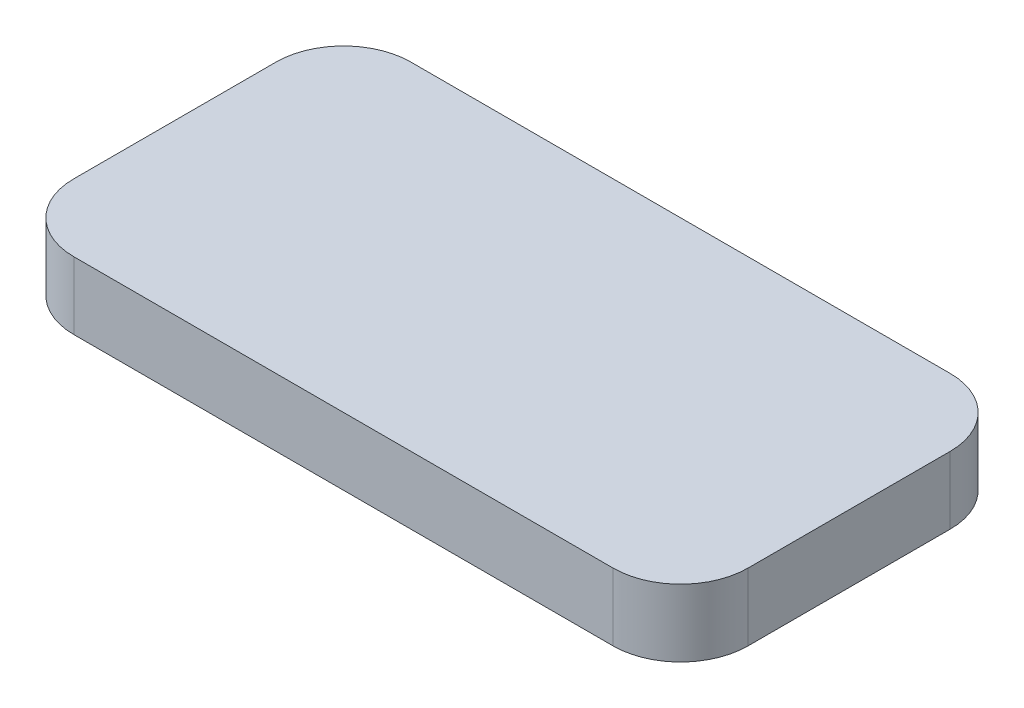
ISO-10303-21;
HEADER;
FILE_DESCRIPTION(('STEP AP214'),'2;1');
FILE_NAME('part.step','',(''),(''),'','','');
FILE_SCHEMA(('AUTOMOTIVE_DESIGN { 1 0 10303 214 1 1 1 1 }'));
ENDSEC;
DATA;
#1=APPLICATION_CONTEXT('core data for automotive mechanical design processes');
#2=APPLICATION_PROTOCOL_DEFINITION('international standard','automotive_design',2000,#1);
#3=PRODUCT_CONTEXT('',#1,'mechanical');
#4=PRODUCT('Part','Part','',(#3));
#5=PRODUCT_RELATED_PRODUCT_CATEGORY('part','',(#4));
#6=PRODUCT_DEFINITION_FORMATION('','',#4);
#7=PRODUCT_DEFINITION_CONTEXT('part definition',#1,'design');
#8=PRODUCT_DEFINITION('design','',#6,#7);
#9=PRODUCT_DEFINITION_SHAPE('','',#8);
#10=(LENGTH_UNIT() NAMED_UNIT(*) SI_UNIT(.MILLI.,.METRE.));
#11=(NAMED_UNIT(*) PLANE_ANGLE_UNIT() SI_UNIT($,.RADIAN.));
#12=(NAMED_UNIT(*) SI_UNIT($,.STERADIAN.) SOLID_ANGLE_UNIT());
#13=UNCERTAINTY_MEASURE_WITH_UNIT(LENGTH_MEASURE(1.E-05),#10,'distance_accuracy_value','');
#14=(GEOMETRIC_REPRESENTATION_CONTEXT(3) GLOBAL_UNCERTAINTY_ASSIGNED_CONTEXT((#13)) GLOBAL_UNIT_ASSIGNED_CONTEXT((#10,
#11,#12)) REPRESENTATION_CONTEXT('',''));
#15=CARTESIAN_POINT('',(0.,0.,0.));
#16=DIRECTION('',(0.,0.,1.));
#17=DIRECTION('',(1.,0.,0.));
#18=AXIS2_PLACEMENT_3D('',#15,#16,#17);
#19=CARTESIAN_POINT('',(20.,20.,-80.));
#20=DIRECTION('',(0.,-1.,0.));
#21=DIRECTION('',(0.,0.,-1.));
#22=AXIS2_PLACEMENT_3D('',#19,#20,#21);
#23=CYLINDRICAL_SURFACE('',#22,20.);
#24=CARTESIAN_POINT('',(20.,0.,-80.));
#25=DIRECTION('',(0.,1.,0.));
#26=DIRECTION('',(0.,0.,-1.));
#27=AXIS2_PLACEMENT_3D('',#24,#25,#26);
#28=CIRCLE('',#27,20.);
#29=CARTESIAN_POINT('',(20.,0.,-100.));
#30=VERTEX_POINT('',#29);
#31=CARTESIAN_POINT('',(0.,0.,-80.));
#32=VERTEX_POINT('',#31);
#33=EDGE_CURVE('E101',#30,#32,#28,.T.);
#34=ORIENTED_EDGE('',*,*,#33,.T.);
#35=DIRECTION('',(0.,-1.,0.));
#36=VECTOR('',#35,1.);
#37=CARTESIAN_POINT('',(0.,20.,-80.));
#38=LINE('',#37,#36);
#39=CARTESIAN_POINT('',(0.,20.,-80.));
#40=VERTEX_POINT('',#39);
#41=EDGE_CURVE('E11',#40,#32,#38,.T.);
#42=ORIENTED_EDGE('',*,*,#41,.F.);
#43=CARTESIAN_POINT('',(20.,20.,-80.));
#44=DIRECTION('',(0.,1.,0.));
#45=DIRECTION('',(0.,0.,-1.));
#46=AXIS2_PLACEMENT_3D('',#43,#44,#45);
#47=CIRCLE('',#46,20.);
#48=CARTESIAN_POINT('',(20.,20.,-100.));
#49=VERTEX_POINT('',#48);
#50=EDGE_CURVE('E128',#49,#40,#47,.T.);
#51=ORIENTED_EDGE('',*,*,#50,.F.);
#52=DIRECTION('',(0.,-1.,0.));
#53=VECTOR('',#52,1.);
#54=CARTESIAN_POINT('',(20.,20.,-100.));
#55=LINE('',#54,#53);
#56=EDGE_CURVE('E114',#49,#30,#55,.T.);
#57=ORIENTED_EDGE('',*,*,#56,.T.);
#58=EDGE_LOOP('',(#34,#42,#51,#57));
#59=FACE_BOUND('',#58,.T.);
#60=ADVANCED_FACE('F33',(#59),#23,.T.);
#61=CARTESIAN_POINT('',(0.,20.,-20.));
#62=DIRECTION('',(1.,0.,0.));
#63=DIRECTION('',(0.,0.,-1.));
#64=AXIS2_PLACEMENT_3D('',#61,#62,#63);
#65=PLANE('',#64);
#66=DIRECTION('',(0.,0.,1.));
#67=VECTOR('',#66,1.);
#68=CARTESIAN_POINT('',(0.,0.,-20.));
#69=LINE('',#68,#67);
#70=CARTESIAN_POINT('',(0.,0.,-20.));
#71=VERTEX_POINT('',#70);
#72=EDGE_CURVE('E97',#32,#71,#69,.T.);
#73=ORIENTED_EDGE('',*,*,#72,.T.);
#74=DIRECTION('',(0.,-1.,0.));
#75=VECTOR('',#74,1.);
#76=CARTESIAN_POINT('',(0.,20.,-20.));
#77=LINE('',#76,#75);
#78=CARTESIAN_POINT('',(0.,20.,-20.));
#79=VERTEX_POINT('',#78);
#80=EDGE_CURVE('E40',#79,#71,#77,.T.);
#81=ORIENTED_EDGE('',*,*,#80,.F.);
#82=DIRECTION('',(0.,0.,1.));
#83=VECTOR('',#82,1.);
#84=CARTESIAN_POINT('',(0.,20.,-20.));
#85=LINE('',#84,#83);
#86=EDGE_CURVE('E110',#40,#79,#85,.T.);
#87=ORIENTED_EDGE('',*,*,#86,.F.);
#88=ORIENTED_EDGE('',*,*,#41,.T.);
#89=EDGE_LOOP('',(#73,#81,#87,#88));
#90=FACE_BOUND('',#89,.T.);
#91=ADVANCED_FACE('F109',(#90),#65,.F.);
#92=CARTESIAN_POINT('',(20.,20.,-20.));
#93=DIRECTION('',(0.,-1.,0.));
#94=DIRECTION('',(0.,0.,-1.));
#95=AXIS2_PLACEMENT_3D('',#92,#93,#94);
#96=CYLINDRICAL_SURFACE('',#95,20.);
#97=CARTESIAN_POINT('',(20.,0.,-20.));
#98=DIRECTION('',(0.,1.,0.));
#99=DIRECTION('',(0.,0.,1.));
#100=AXIS2_PLACEMENT_3D('',#97,#98,#99);
#101=CIRCLE('',#100,20.);
#102=CARTESIAN_POINT('',(20.,0.,0.));
#103=VERTEX_POINT('',#102);
#104=EDGE_CURVE('E103',#71,#103,#101,.T.);
#105=ORIENTED_EDGE('',*,*,#104,.T.);
#106=DIRECTION('',(0.,-1.,0.));
#107=VECTOR('',#106,1.);
#108=CARTESIAN_POINT('',(20.,20.,0.));
#109=LINE('',#108,#107);
#110=CARTESIAN_POINT('',(20.,20.,0.));
#111=VERTEX_POINT('',#110);
#112=EDGE_CURVE('E154',#111,#103,#109,.T.);
#113=ORIENTED_EDGE('',*,*,#112,.F.);
#114=CARTESIAN_POINT('',(20.,20.,-20.));
#115=DIRECTION('',(0.,1.,0.));
#116=DIRECTION('',(0.,0.,1.));
#117=AXIS2_PLACEMENT_3D('',#114,#115,#116);
#118=CIRCLE('',#117,20.);
#119=EDGE_CURVE('E131',#79,#111,#118,.T.);
#120=ORIENTED_EDGE('',*,*,#119,.F.);
#121=ORIENTED_EDGE('',*,*,#80,.T.);
#122=EDGE_LOOP('',(#105,#113,#120,#121));
#123=FACE_BOUND('',#122,.T.);
#124=ADVANCED_FACE('F158',(#123),#96,.T.);
#125=CARTESIAN_POINT('',(20.,20.,0.));
#126=DIRECTION('',(0.,0.,-1.));
#127=DIRECTION('',(-1.,0.,0.));
#128=AXIS2_PLACEMENT_3D('',#125,#126,#127);
#129=PLANE('',#128);
#130=DIRECTION('',(1.,0.,0.));
#131=VECTOR('',#130,1.);
#132=CARTESIAN_POINT('',(20.,0.,0.));
#133=LINE('',#132,#131);
#134=CARTESIAN_POINT('',(180.,0.,0.));
#135=VERTEX_POINT('',#134);
#136=EDGE_CURVE('E118',#103,#135,#133,.T.);
#137=ORIENTED_EDGE('',*,*,#136,.T.);
#138=DIRECTION('',(0.,-1.,0.));
#139=VECTOR('',#138,1.);
#140=CARTESIAN_POINT('',(180.,20.,0.));
#141=LINE('',#140,#139);
#142=CARTESIAN_POINT('',(180.,20.,0.));
#143=VERTEX_POINT('',#142);
#144=EDGE_CURVE('E151',#143,#135,#141,.T.);
#145=ORIENTED_EDGE('',*,*,#144,.F.);
#146=DIRECTION('',(1.,0.,0.));
#147=VECTOR('',#146,1.);
#148=CARTESIAN_POINT('',(20.,20.,0.));
#149=LINE('',#148,#147);
#150=EDGE_CURVE('E133',#111,#143,#149,.T.);
#151=ORIENTED_EDGE('',*,*,#150,.F.);
#152=ORIENTED_EDGE('',*,*,#112,.T.);
#153=EDGE_LOOP('',(#137,#145,#151,#152));
#154=FACE_BOUND('',#153,.T.);
#155=ADVANCED_FACE('F166',(#154),#129,.F.);
#156=CARTESIAN_POINT('',(180.,20.,-20.));
#157=DIRECTION('',(0.,-1.,0.));
#158=DIRECTION('',(0.,0.,-1.));
#159=AXIS2_PLACEMENT_3D('',#156,#157,#158);
#160=CYLINDRICAL_SURFACE('',#159,20.);
#161=CARTESIAN_POINT('',(180.,0.,-20.));
#162=DIRECTION('',(0.,1.,0.));
#163=DIRECTION('',(0.,0.,1.));
#164=AXIS2_PLACEMENT_3D('',#161,#162,#163);
#165=CIRCLE('',#164,20.);
#166=CARTESIAN_POINT('',(200.,0.,-20.));
#167=VERTEX_POINT('',#166);
#168=EDGE_CURVE('E120',#135,#167,#165,.T.);
#169=ORIENTED_EDGE('',*,*,#168,.T.);
#170=DIRECTION('',(0.,-1.,0.));
#171=VECTOR('',#170,1.);
#172=CARTESIAN_POINT('',(200.,20.,-20.));
#173=LINE('',#172,#171);
#174=CARTESIAN_POINT('',(200.,20.,-20.));
#175=VERTEX_POINT('',#174);
#176=EDGE_CURVE('E148',#175,#167,#173,.T.);
#177=ORIENTED_EDGE('',*,*,#176,.F.);
#178=CARTESIAN_POINT('',(180.,20.,-20.));
#179=DIRECTION('',(0.,1.,0.));
#180=DIRECTION('',(0.,0.,1.));
#181=AXIS2_PLACEMENT_3D('',#178,#179,#180);
#182=CIRCLE('',#181,20.);
#183=EDGE_CURVE('E135',#143,#175,#182,.T.);
#184=ORIENTED_EDGE('',*,*,#183,.F.);
#185=ORIENTED_EDGE('',*,*,#144,.T.);
#186=EDGE_LOOP('',(#169,#177,#184,#185));
#187=FACE_BOUND('',#186,.T.);
#188=ADVANCED_FACE('F169',(#187),#160,.T.);
#189=CARTESIAN_POINT('',(200.,20.,-20.));
#190=DIRECTION('',(-1.,0.,0.));
#191=DIRECTION('',(0.,0.,1.));
#192=AXIS2_PLACEMENT_3D('',#189,#190,#191);
#193=PLANE('',#192);
#194=DIRECTION('',(0.,0.,-1.));
#195=VECTOR('',#194,1.);
#196=CARTESIAN_POINT('',(200.,0.,-20.));
#197=LINE('',#196,#195);
#198=CARTESIAN_POINT('',(200.,0.,-80.));
#199=VERTEX_POINT('',#198);
#200=EDGE_CURVE('E122',#167,#199,#197,.T.);
#201=ORIENTED_EDGE('',*,*,#200,.T.);
#202=DIRECTION('',(0.,-1.,0.));
#203=VECTOR('',#202,1.);
#204=CARTESIAN_POINT('',(200.,20.,-80.));
#205=LINE('',#204,#203);
#206=CARTESIAN_POINT('',(200.,20.,-80.));
#207=VERTEX_POINT('',#206);
#208=EDGE_CURVE('E145',#207,#199,#205,.T.);
#209=ORIENTED_EDGE('',*,*,#208,.F.);
#210=DIRECTION('',(0.,0.,-1.));
#211=VECTOR('',#210,1.);
#212=CARTESIAN_POINT('',(200.,20.,-20.));
#213=LINE('',#212,#211);
#214=EDGE_CURVE('E137',#175,#207,#213,.T.);
#215=ORIENTED_EDGE('',*,*,#214,.F.);
#216=ORIENTED_EDGE('',*,*,#176,.T.);
#217=EDGE_LOOP('',(#201,#209,#215,#216));
#218=FACE_BOUND('',#217,.T.);
#219=ADVANCED_FACE('F174',(#218),#193,.F.);
#220=CARTESIAN_POINT('',(180.,20.,-80.));
#221=DIRECTION('',(0.,-1.,0.));
#222=DIRECTION('',(0.,0.,-1.));
#223=AXIS2_PLACEMENT_3D('',#220,#221,#222);
#224=CYLINDRICAL_SURFACE('',#223,20.);
#225=CARTESIAN_POINT('',(180.,0.,-80.));
#226=DIRECTION('',(0.,1.,0.));
#227=DIRECTION('',(0.,0.,-1.));
#228=AXIS2_PLACEMENT_3D('',#225,#226,#227);
#229=CIRCLE('',#228,20.);
#230=CARTESIAN_POINT('',(180.,0.,-100.));
#231=VERTEX_POINT('',#230);
#232=EDGE_CURVE('E124',#199,#231,#229,.T.);
#233=ORIENTED_EDGE('',*,*,#232,.T.);
#234=DIRECTION('',(0.,-1.,0.));
#235=VECTOR('',#234,1.);
#236=CARTESIAN_POINT('',(180.,20.,-100.));
#237=LINE('',#236,#235);
#238=CARTESIAN_POINT('',(180.,20.,-100.));
#239=VERTEX_POINT('',#238);
#240=EDGE_CURVE('E142',#239,#231,#237,.T.);
#241=ORIENTED_EDGE('',*,*,#240,.F.);
#242=CARTESIAN_POINT('',(180.,20.,-80.));
#243=DIRECTION('',(0.,1.,0.));
#244=DIRECTION('',(0.,0.,-1.));
#245=AXIS2_PLACEMENT_3D('',#242,#243,#244);
#246=CIRCLE('',#245,20.);
#247=EDGE_CURVE('E52',#207,#239,#246,.T.);
#248=ORIENTED_EDGE('',*,*,#247,.F.);
#249=ORIENTED_EDGE('',*,*,#208,.T.);
#250=EDGE_LOOP('',(#233,#241,#248,#249));
#251=FACE_BOUND('',#250,.T.);
#252=ADVANCED_FACE('F177',(#251),#224,.T.);
#253=CARTESIAN_POINT('',(20.,20.,-100.));
#254=DIRECTION('',(0.,0.,1.));
#255=DIRECTION('',(1.,0.,0.));
#256=AXIS2_PLACEMENT_3D('',#253,#254,#255);
#257=PLANE('',#256);
#258=DIRECTION('',(-1.,0.,0.));
#259=VECTOR('',#258,1.);
#260=CARTESIAN_POINT('',(20.,0.,-100.));
#261=LINE('',#260,#259);
#262=EDGE_CURVE('E126',#231,#30,#261,.T.);
#263=ORIENTED_EDGE('',*,*,#262,.T.);
#264=ORIENTED_EDGE('',*,*,#56,.F.);
#265=DIRECTION('',(-1.,0.,0.));
#266=VECTOR('',#265,1.);
#267=CARTESIAN_POINT('',(20.,20.,-100.));
#268=LINE('',#267,#266);
#269=EDGE_CURVE('E47',#239,#49,#268,.T.);
#270=ORIENTED_EDGE('',*,*,#269,.F.);
#271=ORIENTED_EDGE('',*,*,#240,.T.);
#272=EDGE_LOOP('',(#263,#264,#270,#271));
#273=FACE_BOUND('',#272,.T.);
#274=ADVANCED_FACE('F179',(#273),#257,.F.);
#275=CARTESIAN_POINT('',(20.,20.,-80.));
#276=DIRECTION('',(0.,-1.,0.));
#277=DIRECTION('',(0.,0.,-1.));
#278=AXIS2_PLACEMENT_3D('',#275,#276,#277);
#279=PLANE('',#278);
#280=ORIENTED_EDGE('',*,*,#50,.T.);
#281=ORIENTED_EDGE('',*,*,#86,.T.);
#282=ORIENTED_EDGE('',*,*,#119,.T.);
#283=ORIENTED_EDGE('',*,*,#150,.T.);
#284=ORIENTED_EDGE('',*,*,#183,.T.);
#285=ORIENTED_EDGE('',*,*,#214,.T.);
#286=ORIENTED_EDGE('',*,*,#247,.T.);
#287=ORIENTED_EDGE('',*,*,#269,.T.);
#288=EDGE_LOOP('',(#280,#281,#282,#283,#284,#285,#286,#287));
#289=FACE_BOUND('',#288,.T.);
#290=ADVANCED_FACE('F161',(#289),#279,.F.);
#291=CARTESIAN_POINT('',(20.,0.,-80.));
#292=DIRECTION('',(0.,-1.,0.));
#293=DIRECTION('',(0.,0.,-1.));
#294=AXIS2_PLACEMENT_3D('',#291,#292,#293);
#295=PLANE('',#294);
#296=ORIENTED_EDGE('',*,*,#33,.F.);
#297=ORIENTED_EDGE('',*,*,#262,.F.);
#298=ORIENTED_EDGE('',*,*,#232,.F.);
#299=ORIENTED_EDGE('',*,*,#200,.F.);
#300=ORIENTED_EDGE('',*,*,#168,.F.);
#301=ORIENTED_EDGE('',*,*,#136,.F.);
#302=ORIENTED_EDGE('',*,*,#104,.F.);
#303=ORIENTED_EDGE('',*,*,#72,.F.);
#304=EDGE_LOOP('',(#296,#297,#298,#299,#300,#301,#302,#303));
#305=FACE_BOUND('',#304,.T.);
#306=ADVANCED_FACE('F98',(#305),#295,.T.);
#307=CLOSED_SHELL('',(#60,#91,#124,#155,#188,#219,#252,#274,#290,#306));
#308=MANIFOLD_SOLID_BREP('B2',#307);
#309=ADVANCED_BREP_SHAPE_REPRESENTATION('',(#18,#308),#14);
#310=SHAPE_DEFINITION_REPRESENTATION(#9,#309);
ENDSEC;
END-ISO-10303-21;
